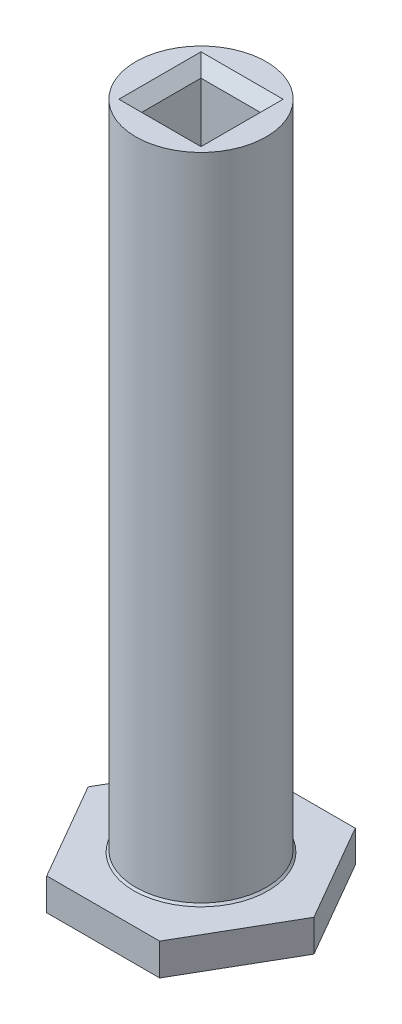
ISO-10303-21;
HEADER;
FILE_DESCRIPTION(('STEP AP214'),'2;1');
FILE_NAME('part.step','',(''),(''),'','','');
FILE_SCHEMA(('AUTOMOTIVE_DESIGN { 1 0 10303 214 1 1 1 1 }'));
ENDSEC;
DATA;
#1=APPLICATION_CONTEXT('core data for automotive mechanical design processes');
#2=APPLICATION_PROTOCOL_DEFINITION('international standard','automotive_design',2000,#1);
#3=PRODUCT_CONTEXT('',#1,'mechanical');
#4=PRODUCT('Part','Part','',(#3));
#5=PRODUCT_RELATED_PRODUCT_CATEGORY('part','',(#4));
#6=PRODUCT_DEFINITION_FORMATION('','',#4);
#7=PRODUCT_DEFINITION_CONTEXT('part definition',#1,'design');
#8=PRODUCT_DEFINITION('design','',#6,#7);
#9=PRODUCT_DEFINITION_SHAPE('','',#8);
#10=(LENGTH_UNIT() NAMED_UNIT(*) SI_UNIT(.MILLI.,.METRE.));
#11=(NAMED_UNIT(*) PLANE_ANGLE_UNIT() SI_UNIT($,.RADIAN.));
#12=(NAMED_UNIT(*) SI_UNIT($,.STERADIAN.) SOLID_ANGLE_UNIT());
#13=UNCERTAINTY_MEASURE_WITH_UNIT(LENGTH_MEASURE(1.E-05),#10,'distance_accuracy_value','');
#14=(GEOMETRIC_REPRESENTATION_CONTEXT(3) GLOBAL_UNCERTAINTY_ASSIGNED_CONTEXT((#13)) GLOBAL_UNIT_ASSIGNED_CONTEXT((#10,
#11,#12)) REPRESENTATION_CONTEXT('',''));
#15=CARTESIAN_POINT('',(0.,0.,0.));
#16=DIRECTION('',(0.,0.,1.));
#17=DIRECTION('',(1.,0.,0.));
#18=AXIS2_PLACEMENT_3D('',#15,#16,#17);
#19=CARTESIAN_POINT('',(0.,133.223,0.));
#20=DIRECTION('',(0.,-1.,0.));
#21=DIRECTION('',(0.,0.,-1.));
#22=AXIS2_PLACEMENT_3D('',#19,#20,#21);
#23=CYLINDRICAL_SURFACE('',#22,12.7);
#24=CARTESIAN_POINT('',(0.,6.604,0.));
#25=DIRECTION('',(0.,1.,0.));
#26=DIRECTION('',(0.,0.,1.));
#27=AXIS2_PLACEMENT_3D('',#24,#25,#26);
#28=CIRCLE('',#27,12.7);
#29=CARTESIAN_POINT('',(0.,6.604,12.7));
#30=VERTEX_POINT('',#29);
#31=EDGE_CURVE('E187',#30,#30,#28,.T.);
#32=ORIENTED_EDGE('',*,*,#31,.T.);
#33=EDGE_LOOP('',(#32));
#34=FACE_BOUND('',#33,.T.);
#35=CARTESIAN_POINT('',(0.,133.223,0.));
#36=DIRECTION('',(0.,1.,0.));
#37=DIRECTION('',(0.,0.,1.));
#38=AXIS2_PLACEMENT_3D('',#35,#36,#37);
#39=CIRCLE('',#38,12.7);
#40=CARTESIAN_POINT('',(0.,133.223,12.7));
#41=VERTEX_POINT('',#40);
#42=EDGE_CURVE('E178',#41,#41,#39,.T.);
#43=ORIENTED_EDGE('',*,*,#42,.F.);
#44=EDGE_LOOP('',(#43));
#45=FACE_BOUND('',#44,.T.);
#46=ADVANCED_FACE('F43',(#34,#45),#23,.T.);
#47=CARTESIAN_POINT('',(0.,133.223,0.));
#48=DIRECTION('',(0.,1.,0.));
#49=DIRECTION('',(0.,0.,1.));
#50=AXIS2_PLACEMENT_3D('',#47,#48,#49);
#51=PLANE('',#50);
#52=DIRECTION('',(-1.,0.,0.));
#53=VECTOR('',#52,1.);
#54=CARTESIAN_POINT('',(-5.7785,133.223,8.00099999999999));
#55=LINE('',#54,#53);
#56=CARTESIAN_POINT('',(8.00099999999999,133.223,8.00099999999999));
#57=VERTEX_POINT('',#56);
#58=CARTESIAN_POINT('',(-8.00099999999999,133.223,8.00099999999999));
#59=VERTEX_POINT('',#58);
#60=EDGE_CURVE('E196',#57,#59,#55,.T.);
#61=ORIENTED_EDGE('',*,*,#60,.T.);
#62=DIRECTION('',(0.,0.,-1.));
#63=VECTOR('',#62,1.);
#64=CARTESIAN_POINT('',(-8.00099999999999,133.223,-5.7785));
#65=LINE('',#64,#63);
#66=CARTESIAN_POINT('',(-8.00099999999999,133.223,-8.00099999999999));
#67=VERTEX_POINT('',#66);
#68=EDGE_CURVE('E202',#59,#67,#65,.T.);
#69=ORIENTED_EDGE('',*,*,#68,.T.);
#70=DIRECTION('',(1.,0.,0.));
#71=VECTOR('',#70,1.);
#72=CARTESIAN_POINT('',(5.7785,133.223,-8.00099999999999));
#73=LINE('',#72,#71);
#74=CARTESIAN_POINT('',(8.00099999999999,133.223,-8.00099999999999));
#75=VERTEX_POINT('',#74);
#76=EDGE_CURVE('E200',#67,#75,#73,.T.);
#77=ORIENTED_EDGE('',*,*,#76,.T.);
#78=DIRECTION('',(0.,0.,1.));
#79=VECTOR('',#78,1.);
#80=CARTESIAN_POINT('',(8.00099999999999,133.223,5.7785));
#81=LINE('',#80,#79);
#82=EDGE_CURVE('E198',#75,#57,#81,.T.);
#83=ORIENTED_EDGE('',*,*,#82,.T.);
#84=EDGE_LOOP('',(#61,#69,#77,#83));
#85=FACE_BOUND('',#84,.T.);
#86=ORIENTED_EDGE('',*,*,#42,.T.);
#87=EDGE_LOOP('',(#86));
#88=FACE_BOUND('',#87,.T.);
#89=ADVANCED_FACE('F274',(#85,#88),#51,.T.);
#90=CARTESIAN_POINT('',(5.7785,117.348,-5.7785));
#91=DIRECTION('',(1.,0.,0.));
#92=DIRECTION('',(0.,0.,-1.));
#93=AXIS2_PLACEMENT_3D('',#90,#91,#92);
#94=PLANE('',#93);
#95=DIRECTION('',(0.,1.,0.));
#96=VECTOR('',#95,1.);
#97=CARTESIAN_POINT('',(5.7785,117.348,5.7785));
#98=LINE('',#97,#96);
#99=CARTESIAN_POINT('',(5.7785,117.348,5.7785));
#100=VERTEX_POINT('',#99);
#101=CARTESIAN_POINT('',(5.7785,131.0005,5.7785));
#102=VERTEX_POINT('',#101);
#103=EDGE_CURVE('E176',#100,#102,#98,.T.);
#104=ORIENTED_EDGE('',*,*,#103,.T.);
#105=DIRECTION('',(0.,0.,-1.));
#106=VECTOR('',#105,1.);
#107=CARTESIAN_POINT('',(5.7785,131.0005,-5.7785));
#108=LINE('',#107,#106);
#109=CARTESIAN_POINT('',(5.7785,131.0005,-5.7785));
#110=VERTEX_POINT('',#109);
#111=EDGE_CURVE('E53',#102,#110,#108,.T.);
#112=ORIENTED_EDGE('',*,*,#111,.T.);
#113=DIRECTION('',(0.,1.,0.));
#114=VECTOR('',#113,1.);
#115=CARTESIAN_POINT('',(5.7785,117.348,-5.7785));
#116=LINE('',#115,#114);
#117=CARTESIAN_POINT('',(5.7785,117.348,-5.7785));
#118=VERTEX_POINT('',#117);
#119=EDGE_CURVE('E175',#118,#110,#116,.T.);
#120=ORIENTED_EDGE('',*,*,#119,.F.);
#121=DIRECTION('',(0.,0.,-1.));
#122=VECTOR('',#121,1.);
#123=CARTESIAN_POINT('',(5.7785,117.348,-5.7785));
#124=LINE('',#123,#122);
#125=EDGE_CURVE('E158',#100,#118,#124,.T.);
#126=ORIENTED_EDGE('',*,*,#125,.F.);
#127=EDGE_LOOP('',(#104,#112,#120,#126));
#128=FACE_BOUND('',#127,.T.);
#129=ADVANCED_FACE('F280',(#128),#94,.F.);
#130=CARTESIAN_POINT('',(-5.7785,117.348,5.7785));
#131=DIRECTION('',(0.,0.,1.));
#132=DIRECTION('',(1.,0.,0.));
#133=AXIS2_PLACEMENT_3D('',#130,#131,#132);
#134=PLANE('',#133);
#135=DIRECTION('',(0.,1.,0.));
#136=VECTOR('',#135,1.);
#137=CARTESIAN_POINT('',(-5.7785,117.348,5.7785));
#138=LINE('',#137,#136);
#139=CARTESIAN_POINT('',(-5.7785,117.348,5.7785));
#140=VERTEX_POINT('',#139);
#141=CARTESIAN_POINT('',(-5.7785,131.0005,5.7785));
#142=VERTEX_POINT('',#141);
#143=EDGE_CURVE('E179',#140,#142,#138,.T.);
#144=ORIENTED_EDGE('',*,*,#143,.T.);
#145=DIRECTION('',(1.,0.,0.));
#146=VECTOR('',#145,1.);
#147=CARTESIAN_POINT('',(5.7785,131.0005,5.7785));
#148=LINE('',#147,#146);
#149=EDGE_CURVE('E11',#142,#102,#148,.T.);
#150=ORIENTED_EDGE('',*,*,#149,.T.);
#151=ORIENTED_EDGE('',*,*,#103,.F.);
#152=DIRECTION('',(1.,0.,0.));
#153=VECTOR('',#152,1.);
#154=CARTESIAN_POINT('',(-5.7785,117.348,5.7785));
#155=LINE('',#154,#153);
#156=EDGE_CURVE('E172',#140,#100,#155,.T.);
#157=ORIENTED_EDGE('',*,*,#156,.F.);
#158=EDGE_LOOP('',(#144,#150,#151,#157));
#159=FACE_BOUND('',#158,.T.);
#160=ADVANCED_FACE('F332',(#159),#134,.F.);
#161=CARTESIAN_POINT('',(-5.7785,117.348,-5.7785));
#162=DIRECTION('',(-1.,0.,0.));
#163=DIRECTION('',(0.,0.,1.));
#164=AXIS2_PLACEMENT_3D('',#161,#162,#163);
#165=PLANE('',#164);
#166=DIRECTION('',(0.,1.,0.));
#167=VECTOR('',#166,1.);
#168=CARTESIAN_POINT('',(-5.7785,117.348,-5.7785));
#169=LINE('',#168,#167);
#170=CARTESIAN_POINT('',(-5.7785,117.348,-5.7785));
#171=VERTEX_POINT('',#170);
#172=CARTESIAN_POINT('',(-5.7785,131.0005,-5.7785));
#173=VERTEX_POINT('',#172);
#174=EDGE_CURVE('E181',#171,#173,#169,.T.);
#175=ORIENTED_EDGE('',*,*,#174,.T.);
#176=DIRECTION('',(0.,0.,1.));
#177=VECTOR('',#176,1.);
#178=CARTESIAN_POINT('',(-5.7785,131.0005,5.7785));
#179=LINE('',#178,#177);
#180=EDGE_CURVE('E193',#173,#142,#179,.T.);
#181=ORIENTED_EDGE('',*,*,#180,.T.);
#182=ORIENTED_EDGE('',*,*,#143,.F.);
#183=DIRECTION('',(0.,0.,1.));
#184=VECTOR('',#183,1.);
#185=CARTESIAN_POINT('',(-5.7785,117.348,-5.7785));
#186=LINE('',#185,#184);
#187=EDGE_CURVE('E169',#171,#140,#186,.T.);
#188=ORIENTED_EDGE('',*,*,#187,.F.);
#189=EDGE_LOOP('',(#175,#181,#182,#188));
#190=FACE_BOUND('',#189,.T.);
#191=ADVANCED_FACE('F327',(#190),#165,.F.);
#192=CARTESIAN_POINT('',(-5.7785,117.348,-5.7785));
#193=DIRECTION('',(0.,0.,-1.));
#194=DIRECTION('',(-1.,0.,0.));
#195=AXIS2_PLACEMENT_3D('',#192,#193,#194);
#196=PLANE('',#195);
#197=ORIENTED_EDGE('',*,*,#119,.T.);
#198=DIRECTION('',(-1.,0.,0.));
#199=VECTOR('',#198,1.);
#200=CARTESIAN_POINT('',(-5.7785,131.0005,-5.7785));
#201=LINE('',#200,#199);
#202=EDGE_CURVE('E205',#110,#173,#201,.T.);
#203=ORIENTED_EDGE('',*,*,#202,.T.);
#204=ORIENTED_EDGE('',*,*,#174,.F.);
#205=DIRECTION('',(-1.,0.,0.));
#206=VECTOR('',#205,1.);
#207=CARTESIAN_POINT('',(-5.7785,117.348,-5.7785));
#208=LINE('',#207,#206);
#209=EDGE_CURVE('E161',#118,#171,#208,.T.);
#210=ORIENTED_EDGE('',*,*,#209,.F.);
#211=EDGE_LOOP('',(#197,#203,#204,#210));
#212=FACE_BOUND('',#211,.T.);
#213=ADVANCED_FACE('F323',(#212),#196,.F.);
#214=CARTESIAN_POINT('',(0.,117.348,0.));
#215=DIRECTION('',(0.,1.,0.));
#216=DIRECTION('',(0.,0.,1.));
#217=AXIS2_PLACEMENT_3D('',#214,#215,#216);
#218=PLANE('',#217);
#219=ORIENTED_EDGE('',*,*,#125,.T.);
#220=ORIENTED_EDGE('',*,*,#209,.T.);
#221=ORIENTED_EDGE('',*,*,#187,.T.);
#222=ORIENTED_EDGE('',*,*,#156,.T.);
#223=EDGE_LOOP('',(#219,#220,#221,#222));
#224=FACE_BOUND('',#223,.T.);
#225=ADVANCED_FACE('F330',(#224),#218,.T.);
#226=CARTESIAN_POINT('',(-10.9985226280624,6.223,19.05));
#227=DIRECTION('',(0.,0.,-1.));
#228=DIRECTION('',(-1.,0.,0.));
#229=AXIS2_PLACEMENT_3D('',#226,#227,#228);
#230=PLANE('',#229);
#231=DIRECTION('',(1.,0.,0.));
#232=VECTOR('',#231,1.);
#233=CARTESIAN_POINT('',(-10.9985226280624,0.,19.05));
#234=LINE('',#233,#232);
#235=CARTESIAN_POINT('',(-10.9985226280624,0.,19.05));
#236=VERTEX_POINT('',#235);
#237=CARTESIAN_POINT('',(10.9985226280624,0.,19.05));
#238=VERTEX_POINT('',#237);
#239=EDGE_CURVE('E157',#236,#238,#234,.T.);
#240=ORIENTED_EDGE('',*,*,#239,.T.);
#241=DIRECTION('',(0.,-1.,0.));
#242=VECTOR('',#241,1.);
#243=CARTESIAN_POINT('',(10.9985226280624,6.223,19.05));
#244=LINE('',#243,#242);
#245=CARTESIAN_POINT('',(10.9985226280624,6.223,19.05));
#246=VERTEX_POINT('',#245);
#247=EDGE_CURVE('E137',#246,#238,#244,.T.);
#248=ORIENTED_EDGE('',*,*,#247,.F.);
#249=DIRECTION('',(1.,0.,0.));
#250=VECTOR('',#249,1.);
#251=CARTESIAN_POINT('',(-10.9985226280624,6.223,19.05));
#252=LINE('',#251,#250);
#253=CARTESIAN_POINT('',(-10.9985226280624,6.223,19.05));
#254=VERTEX_POINT('',#253);
#255=EDGE_CURVE('E144',#254,#246,#252,.T.);
#256=ORIENTED_EDGE('',*,*,#255,.F.);
#257=DIRECTION('',(0.,-1.,0.));
#258=VECTOR('',#257,1.);
#259=CARTESIAN_POINT('',(-10.9985226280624,6.223,19.05));
#260=LINE('',#259,#258);
#261=EDGE_CURVE('E234',#254,#236,#260,.T.);
#262=ORIENTED_EDGE('',*,*,#261,.T.);
#263=EDGE_LOOP('',(#240,#248,#256,#262));
#264=FACE_BOUND('',#263,.T.);
#265=ADVANCED_FACE('F155',(#264),#230,.F.);
#266=CARTESIAN_POINT('',(10.9985226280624,6.223,19.05));
#267=DIRECTION('',(-0.866025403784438,0.,-0.5));
#268=DIRECTION('',(-0.5,0.,0.866025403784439));
#269=AXIS2_PLACEMENT_3D('',#266,#267,#268);
#270=PLANE('',#269);
#271=DIRECTION('',(0.5,0.,-0.866025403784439));
#272=VECTOR('',#271,1.);
#273=CARTESIAN_POINT('',(10.9985226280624,0.,19.05));
#274=LINE('',#273,#272);
#275=CARTESIAN_POINT('',(21.9970452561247,0.,0.));
#276=VERTEX_POINT('',#275);
#277=EDGE_CURVE('E221',#238,#276,#274,.T.);
#278=ORIENTED_EDGE('',*,*,#277,.T.);
#279=DIRECTION('',(0.,-1.,0.));
#280=VECTOR('',#279,1.);
#281=CARTESIAN_POINT('',(21.9970452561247,6.223,0.));
#282=LINE('',#281,#280);
#283=CARTESIAN_POINT('',(21.9970452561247,6.223,0.));
#284=VERTEX_POINT('',#283);
#285=EDGE_CURVE('E140',#284,#276,#282,.T.);
#286=ORIENTED_EDGE('',*,*,#285,.F.);
#287=DIRECTION('',(0.5,0.,-0.866025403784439));
#288=VECTOR('',#287,1.);
#289=CARTESIAN_POINT('',(10.9985226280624,6.223,19.05));
#290=LINE('',#289,#288);
#291=EDGE_CURVE('E133',#246,#284,#290,.T.);
#292=ORIENTED_EDGE('',*,*,#291,.F.);
#293=ORIENTED_EDGE('',*,*,#247,.T.);
#294=EDGE_LOOP('',(#278,#286,#292,#293));
#295=FACE_BOUND('',#294,.T.);
#296=ADVANCED_FACE('F135',(#295),#270,.F.);
#297=CARTESIAN_POINT('',(21.9970452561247,6.223,0.));
#298=DIRECTION('',(-0.866025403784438,0.,0.5));
#299=DIRECTION('',(0.5,0.,0.866025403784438));
#300=AXIS2_PLACEMENT_3D('',#297,#298,#299);
#301=PLANE('',#300);
#302=DIRECTION('',(-0.5,0.,-0.866025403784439));
#303=VECTOR('',#302,1.);
#304=CARTESIAN_POINT('',(21.9970452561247,0.,0.));
#305=LINE('',#304,#303);
#306=CARTESIAN_POINT('',(10.9985226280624,0.,-19.05));
#307=VERTEX_POINT('',#306);
#308=EDGE_CURVE('E223',#276,#307,#305,.T.);
#309=ORIENTED_EDGE('',*,*,#308,.T.);
#310=DIRECTION('',(0.,-1.,0.));
#311=VECTOR('',#310,1.);
#312=CARTESIAN_POINT('',(10.9985226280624,6.223,-19.05));
#313=LINE('',#312,#311);
#314=CARTESIAN_POINT('',(10.9985226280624,6.223,-19.05));
#315=VERTEX_POINT('',#314);
#316=EDGE_CURVE('E163',#315,#307,#313,.T.);
#317=ORIENTED_EDGE('',*,*,#316,.F.);
#318=DIRECTION('',(-0.5,0.,-0.866025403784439));
#319=VECTOR('',#318,1.);
#320=CARTESIAN_POINT('',(21.9970452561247,6.223,0.));
#321=LINE('',#320,#319);
#322=EDGE_CURVE('E143',#284,#315,#321,.T.);
#323=ORIENTED_EDGE('',*,*,#322,.F.);
#324=ORIENTED_EDGE('',*,*,#285,.T.);
#325=EDGE_LOOP('',(#309,#317,#323,#324));
#326=FACE_BOUND('',#325,.T.);
#327=ADVANCED_FACE('F264',(#326),#301,.F.);
#328=CARTESIAN_POINT('',(10.9985226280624,6.223,-19.05));
#329=DIRECTION('',(0.,0.,1.));
#330=DIRECTION('',(1.,0.,0.));
#331=AXIS2_PLACEMENT_3D('',#328,#329,#330);
#332=PLANE('',#331);
#333=DIRECTION('',(-1.,0.,0.));
#334=VECTOR('',#333,1.);
#335=CARTESIAN_POINT('',(10.9985226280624,0.,-19.05));
#336=LINE('',#335,#334);
#337=CARTESIAN_POINT('',(-10.9985226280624,0.,-19.05));
#338=VERTEX_POINT('',#337);
#339=EDGE_CURVE('E229',#307,#338,#336,.T.);
#340=ORIENTED_EDGE('',*,*,#339,.T.);
#341=DIRECTION('',(0.,-1.,0.));
#342=VECTOR('',#341,1.);
#343=CARTESIAN_POINT('',(-10.9985226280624,6.223,-19.05));
#344=LINE('',#343,#342);
#345=CARTESIAN_POINT('',(-10.9985226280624,6.223,-19.05));
#346=VERTEX_POINT('',#345);
#347=EDGE_CURVE('E239',#346,#338,#344,.T.);
#348=ORIENTED_EDGE('',*,*,#347,.F.);
#349=DIRECTION('',(-1.,0.,0.));
#350=VECTOR('',#349,1.);
#351=CARTESIAN_POINT('',(10.9985226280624,6.223,-19.05));
#352=LINE('',#351,#350);
#353=EDGE_CURVE('E248',#315,#346,#352,.T.);
#354=ORIENTED_EDGE('',*,*,#353,.F.);
#355=ORIENTED_EDGE('',*,*,#316,.T.);
#356=EDGE_LOOP('',(#340,#348,#354,#355));
#357=FACE_BOUND('',#356,.T.);
#358=ADVANCED_FACE('F246',(#357),#332,.F.);
#359=CARTESIAN_POINT('',(-10.9985226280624,6.223,-19.05));
#360=DIRECTION('',(0.866025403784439,0.,0.5));
#361=DIRECTION('',(0.5,0.,-0.866025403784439));
#362=AXIS2_PLACEMENT_3D('',#359,#360,#361);
#363=PLANE('',#362);
#364=DIRECTION('',(-0.5,0.,0.866025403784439));
#365=VECTOR('',#364,1.);
#366=CARTESIAN_POINT('',(-10.9985226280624,0.,-19.05));
#367=LINE('',#366,#365);
#368=CARTESIAN_POINT('',(-21.9970452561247,0.,0.));
#369=VERTEX_POINT('',#368);
#370=EDGE_CURVE('E231',#338,#369,#367,.T.);
#371=ORIENTED_EDGE('',*,*,#370,.T.);
#372=DIRECTION('',(0.,-1.,0.));
#373=VECTOR('',#372,1.);
#374=CARTESIAN_POINT('',(-21.9970452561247,6.223,0.));
#375=LINE('',#374,#373);
#376=CARTESIAN_POINT('',(-21.9970452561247,6.223,0.));
#377=VERTEX_POINT('',#376);
#378=EDGE_CURVE('E236',#377,#369,#375,.T.);
#379=ORIENTED_EDGE('',*,*,#378,.F.);
#380=DIRECTION('',(-0.5,0.,0.866025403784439));
#381=VECTOR('',#380,1.);
#382=CARTESIAN_POINT('',(-10.9985226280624,6.223,-19.05));
#383=LINE('',#382,#381);
#384=EDGE_CURVE('E261',#346,#377,#383,.T.);
#385=ORIENTED_EDGE('',*,*,#384,.F.);
#386=ORIENTED_EDGE('',*,*,#347,.T.);
#387=EDGE_LOOP('',(#371,#379,#385,#386));
#388=FACE_BOUND('',#387,.T.);
#389=ADVANCED_FACE('F257',(#388),#363,.F.);
#390=CARTESIAN_POINT('',(-21.9970452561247,6.223,0.));
#391=DIRECTION('',(0.866025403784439,0.,-0.5));
#392=DIRECTION('',(-0.5,0.,-0.866025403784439));
#393=AXIS2_PLACEMENT_3D('',#390,#391,#392);
#394=PLANE('',#393);
#395=DIRECTION('',(0.5,0.,0.866025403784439));
#396=VECTOR('',#395,1.);
#397=CARTESIAN_POINT('',(-21.9970452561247,0.,0.));
#398=LINE('',#397,#396);
#399=EDGE_CURVE('E153',#369,#236,#398,.T.);
#400=ORIENTED_EDGE('',*,*,#399,.T.);
#401=ORIENTED_EDGE('',*,*,#261,.F.);
#402=DIRECTION('',(0.5,0.,0.866025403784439));
#403=VECTOR('',#402,1.);
#404=CARTESIAN_POINT('',(-21.9970452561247,6.223,0.));
#405=LINE('',#404,#403);
#406=EDGE_CURVE('E149',#377,#254,#405,.T.);
#407=ORIENTED_EDGE('',*,*,#406,.F.);
#408=ORIENTED_EDGE('',*,*,#378,.T.);
#409=EDGE_LOOP('',(#400,#401,#407,#408));
#410=FACE_BOUND('',#409,.T.);
#411=ADVANCED_FACE('F260',(#410),#394,.F.);
#412=CARTESIAN_POINT('',(0.,6.223,0.));
#413=DIRECTION('',(0.,1.,0.));
#414=DIRECTION('',(0.,0.,1.));
#415=AXIS2_PLACEMENT_3D('',#412,#413,#414);
#416=PLANE('',#415);
#417=CARTESIAN_POINT('',(0.,6.223,0.));
#418=DIRECTION('',(0.,1.,0.));
#419=DIRECTION('',(0.,0.,1.));
#420=AXIS2_PLACEMENT_3D('',#417,#418,#419);
#421=CIRCLE('',#420,13.081);
#422=CARTESIAN_POINT('',(0.,6.223,13.081));
#423=VERTEX_POINT('',#422);
#424=EDGE_CURVE('E190',#423,#423,#421,.F.);
#425=ORIENTED_EDGE('',*,*,#424,.T.);
#426=EDGE_LOOP('',(#425));
#427=FACE_BOUND('',#426,.T.);
#428=ORIENTED_EDGE('',*,*,#255,.T.);
#429=ORIENTED_EDGE('',*,*,#291,.T.);
#430=ORIENTED_EDGE('',*,*,#322,.T.);
#431=ORIENTED_EDGE('',*,*,#353,.T.);
#432=ORIENTED_EDGE('',*,*,#384,.T.);
#433=ORIENTED_EDGE('',*,*,#406,.T.);
#434=EDGE_LOOP('',(#428,#429,#430,#431,#432,#433));
#435=FACE_BOUND('',#434,.T.);
#436=ADVANCED_FACE('F147',(#427,#435),#416,.T.);
#437=CARTESIAN_POINT('',(0.,0.,0.));
#438=DIRECTION('',(0.,1.,0.));
#439=DIRECTION('',(0.,0.,1.));
#440=AXIS2_PLACEMENT_3D('',#437,#438,#439);
#441=PLANE('',#440);
#442=ORIENTED_EDGE('',*,*,#239,.F.);
#443=ORIENTED_EDGE('',*,*,#399,.F.);
#444=ORIENTED_EDGE('',*,*,#370,.F.);
#445=ORIENTED_EDGE('',*,*,#339,.F.);
#446=ORIENTED_EDGE('',*,*,#308,.F.);
#447=ORIENTED_EDGE('',*,*,#277,.F.);
#448=EDGE_LOOP('',(#442,#443,#444,#445,#446,#447));
#449=FACE_BOUND('',#448,.T.);
#450=ADVANCED_FACE('F253',(#449),#441,.F.);
#451=CARTESIAN_POINT('',(0.,6.604,0.));
#452=DIRECTION('',(0.,-1.,0.));
#453=DIRECTION('',(0.,0.,-1.));
#454=AXIS2_PLACEMENT_3D('',#451,#452,#453);
#455=CONICAL_SURFACE('',#454,12.7,0.785398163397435);
#456=ORIENTED_EDGE('',*,*,#424,.F.);
#457=EDGE_LOOP('',(#456));
#458=FACE_BOUND('',#457,.T.);
#459=ORIENTED_EDGE('',*,*,#31,.F.);
#460=EDGE_LOOP('',(#459));
#461=FACE_BOUND('',#460,.T.);
#462=ADVANCED_FACE('F287',(#458,#461),#455,.T.);
#463=CARTESIAN_POINT('',(5.7785,131.0005,-5.7785));
#464=DIRECTION('',(-0.707106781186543,0.707106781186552,0.));
#465=DIRECTION('',(0.,0.,1.));
#466=AXIS2_PLACEMENT_3D('',#463,#464,#465);
#467=PLANE('',#466);
#468=DIRECTION('',(-0.577350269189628,-0.577350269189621,-0.577350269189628));
#469=VECTOR('',#468,1.);
#470=CARTESIAN_POINT('',(1.92616666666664,127.148166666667,1.92616666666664));
#471=LINE('',#470,#469);
#472=EDGE_CURVE('E211',#57,#102,#471,.T.);
#473=ORIENTED_EDGE('',*,*,#472,.F.);
#474=ORIENTED_EDGE('',*,*,#82,.F.);
#475=DIRECTION('',(-0.577350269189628,-0.577350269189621,0.577350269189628));
#476=VECTOR('',#475,1.);
#477=CARTESIAN_POINT('',(1.92616666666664,127.148166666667,-1.92616666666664));
#478=LINE('',#477,#476);
#479=EDGE_CURVE('E48',#110,#75,#478,.F.);
#480=ORIENTED_EDGE('',*,*,#479,.F.);
#481=ORIENTED_EDGE('',*,*,#111,.F.);
#482=EDGE_LOOP('',(#473,#474,#480,#481));
#483=FACE_BOUND('',#482,.T.);
#484=ADVANCED_FACE('F46',(#483),#467,.T.);
#485=CARTESIAN_POINT('',(-5.7785,131.0005,-5.7785));
#486=DIRECTION('',(0.,0.707106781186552,0.707106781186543));
#487=DIRECTION('',(1.,0.,0.));
#488=AXIS2_PLACEMENT_3D('',#485,#486,#487);
#489=PLANE('',#488);
#490=ORIENTED_EDGE('',*,*,#479,.T.);
#491=ORIENTED_EDGE('',*,*,#76,.F.);
#492=DIRECTION('',(0.577350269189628,-0.577350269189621,0.577350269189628));
#493=VECTOR('',#492,1.);
#494=CARTESIAN_POINT('',(-5.7785,131.0005,-5.7785));
#495=LINE('',#494,#493);
#496=EDGE_CURVE('E210',#173,#67,#495,.F.);
#497=ORIENTED_EDGE('',*,*,#496,.F.);
#498=ORIENTED_EDGE('',*,*,#202,.F.);
#499=EDGE_LOOP('',(#490,#491,#497,#498));
#500=FACE_BOUND('',#499,.T.);
#501=ADVANCED_FACE('F306',(#500),#489,.T.);
#502=CARTESIAN_POINT('',(-5.7785,131.0005,5.7785));
#503=DIRECTION('',(0.,0.707106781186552,-0.707106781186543));
#504=DIRECTION('',(-1.,0.,0.));
#505=AXIS2_PLACEMENT_3D('',#502,#503,#504);
#506=PLANE('',#505);
#507=ORIENTED_EDGE('',*,*,#472,.T.);
#508=ORIENTED_EDGE('',*,*,#149,.F.);
#509=DIRECTION('',(-0.577350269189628,0.577350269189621,0.577350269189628));
#510=VECTOR('',#509,1.);
#511=CARTESIAN_POINT('',(-1.92616666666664,127.148166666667,1.92616666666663));
#512=LINE('',#511,#510);
#513=EDGE_CURVE('E208',#59,#142,#512,.F.);
#514=ORIENTED_EDGE('',*,*,#513,.F.);
#515=ORIENTED_EDGE('',*,*,#60,.F.);
#516=EDGE_LOOP('',(#507,#508,#514,#515));
#517=FACE_BOUND('',#516,.T.);
#518=ADVANCED_FACE('F300',(#517),#506,.T.);
#519=CARTESIAN_POINT('',(-5.7785,131.0005,-5.7785));
#520=DIRECTION('',(0.707106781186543,0.707106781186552,0.));
#521=DIRECTION('',(0.,0.,-1.));
#522=AXIS2_PLACEMENT_3D('',#519,#520,#521);
#523=PLANE('',#522);
#524=ORIENTED_EDGE('',*,*,#496,.T.);
#525=ORIENTED_EDGE('',*,*,#68,.F.);
#526=ORIENTED_EDGE('',*,*,#513,.T.);
#527=ORIENTED_EDGE('',*,*,#180,.F.);
#528=EDGE_LOOP('',(#524,#525,#526,#527));
#529=FACE_BOUND('',#528,.T.);
#530=ADVANCED_FACE('F294',(#529),#523,.T.);
#531=CLOSED_SHELL('',(#46,#89,#129,#160,#191,#213,#225,#265,#296,#327,#358,#389,#411,#436,#450,
#462,#484,#501,#518,#530));
#532=MANIFOLD_SOLID_BREP('B2',#531);
#533=ADVANCED_BREP_SHAPE_REPRESENTATION('',(#18,#532),#14);
#534=SHAPE_DEFINITION_REPRESENTATION(#9,#533);
ENDSEC;
END-ISO-10303-21;
